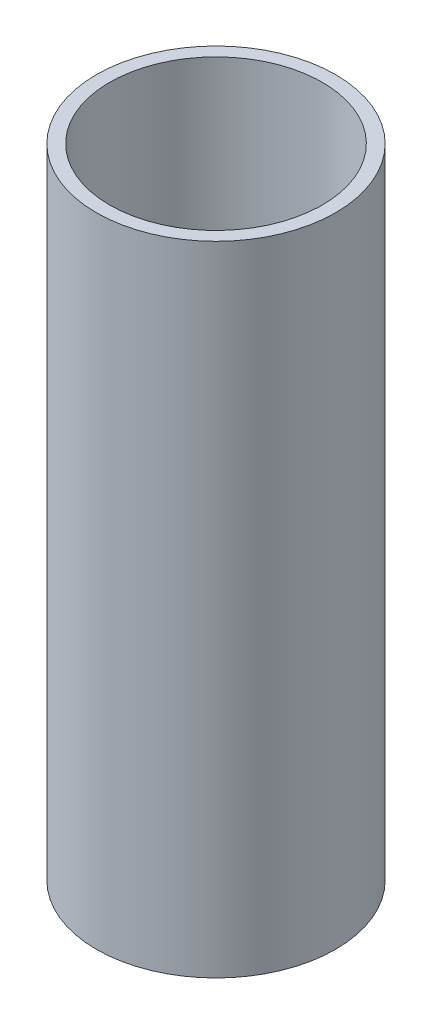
ISO-10303-21;
HEADER;
FILE_DESCRIPTION(('STEP AP214'),'2;1');
FILE_NAME('part.step','',(''),(''),'','','');
FILE_SCHEMA(('AUTOMOTIVE_DESIGN { 1 0 10303 214 1 1 1 1 }'));
ENDSEC;
DATA;
#1=APPLICATION_CONTEXT('core data for automotive mechanical design processes');
#2=APPLICATION_PROTOCOL_DEFINITION('international standard','automotive_design',2000,#1);
#3=PRODUCT_CONTEXT('',#1,'mechanical');
#4=PRODUCT('Part','Part','',(#3));
#5=PRODUCT_RELATED_PRODUCT_CATEGORY('part','',(#4));
#6=PRODUCT_DEFINITION_FORMATION('','',#4);
#7=PRODUCT_DEFINITION_CONTEXT('part definition',#1,'design');
#8=PRODUCT_DEFINITION('design','',#6,#7);
#9=PRODUCT_DEFINITION_SHAPE('','',#8);
#10=(LENGTH_UNIT() NAMED_UNIT(*) SI_UNIT(.MILLI.,.METRE.));
#11=(NAMED_UNIT(*) PLANE_ANGLE_UNIT() SI_UNIT($,.RADIAN.));
#12=(NAMED_UNIT(*) SI_UNIT($,.STERADIAN.) SOLID_ANGLE_UNIT());
#13=UNCERTAINTY_MEASURE_WITH_UNIT(LENGTH_MEASURE(1.E-05),#10,'distance_accuracy_value','');
#14=(GEOMETRIC_REPRESENTATION_CONTEXT(3) GLOBAL_UNCERTAINTY_ASSIGNED_CONTEXT((#13)) GLOBAL_UNIT_ASSIGNED_CONTEXT((#10,
#11,#12)) REPRESENTATION_CONTEXT('',''));
#15=CARTESIAN_POINT('',(0.,0.,0.));
#16=DIRECTION('',(0.,0.,1.));
#17=DIRECTION('',(1.,0.,0.));
#18=AXIS2_PLACEMENT_3D('',#15,#16,#17);
#19=CARTESIAN_POINT('',(0.,480.,0.));
#20=DIRECTION('',(0.,-1.,0.));
#21=DIRECTION('',(0.,0.,-1.));
#22=AXIS2_PLACEMENT_3D('',#19,#20,#21);
#23=CYLINDRICAL_SURFACE('',#22,90.);
#24=CARTESIAN_POINT('',(0.,480.,0.));
#25=DIRECTION('',(0.,1.,0.));
#26=DIRECTION('',(0.,0.,1.));
#27=AXIS2_PLACEMENT_3D('',#24,#25,#26);
#28=CIRCLE('',#27,90.);
#29=CARTESIAN_POINT('',(0.,480.,90.));
#30=VERTEX_POINT('',#29);
#31=EDGE_CURVE('E10',#30,#30,#28,.T.);
#32=ORIENTED_EDGE('',*,*,#31,.F.);
#33=EDGE_LOOP('',(#32));
#34=FACE_BOUND('',#33,.T.);
#35=CARTESIAN_POINT('',(0.,0.,0.));
#36=DIRECTION('',(0.,1.,0.));
#37=DIRECTION('',(0.,0.,1.));
#38=AXIS2_PLACEMENT_3D('',#35,#36,#37);
#39=CIRCLE('',#38,90.);
#40=CARTESIAN_POINT('',(0.,0.,90.));
#41=VERTEX_POINT('',#40);
#42=EDGE_CURVE('E44',#41,#41,#39,.T.);
#43=ORIENTED_EDGE('',*,*,#42,.T.);
#44=EDGE_LOOP('',(#43));
#45=FACE_BOUND('',#44,.T.);
#46=ADVANCED_FACE('F41',(#34,#45),#23,.T.);
#47=CARTESIAN_POINT('',(0.,480.,0.));
#48=DIRECTION('',(0.,1.,0.));
#49=DIRECTION('',(0.,0.,1.));
#50=AXIS2_PLACEMENT_3D('',#47,#48,#49);
#51=PLANE('',#50);
#52=CARTESIAN_POINT('',(0.,480.,0.));
#53=DIRECTION('',(0.,1.,0.));
#54=DIRECTION('',(0.,0.,1.));
#55=AXIS2_PLACEMENT_3D('',#52,#53,#54);
#56=CIRCLE('',#55,80.);
#57=CARTESIAN_POINT('',(0.,480.,80.));
#58=VERTEX_POINT('',#57);
#59=EDGE_CURVE('E59',#58,#58,#56,.T.);
#60=ORIENTED_EDGE('',*,*,#59,.F.);
#61=EDGE_LOOP('',(#60));
#62=FACE_BOUND('',#61,.T.);
#63=ORIENTED_EDGE('',*,*,#31,.T.);
#64=EDGE_LOOP('',(#63));
#65=FACE_BOUND('',#64,.T.);
#66=ADVANCED_FACE('F74',(#62,#65),#51,.T.);
#67=CARTESIAN_POINT('',(0.,0.,0.));
#68=DIRECTION('',(0.,1.,0.));
#69=DIRECTION('',(0.,0.,1.));
#70=AXIS2_PLACEMENT_3D('',#67,#68,#69);
#71=PLANE('',#70);
#72=CARTESIAN_POINT('',(0.,0.,0.));
#73=DIRECTION('',(0.,-1.,0.));
#74=DIRECTION('',(0.,0.,-1.));
#75=AXIS2_PLACEMENT_3D('',#72,#73,#74);
#76=CIRCLE('',#75,80.);
#77=CARTESIAN_POINT('',(0.,0.,-80.));
#78=VERTEX_POINT('',#77);
#79=EDGE_CURVE('E53',#78,#78,#76,.T.);
#80=ORIENTED_EDGE('',*,*,#79,.F.);
#81=EDGE_LOOP('',(#80));
#82=FACE_BOUND('',#81,.T.);
#83=ORIENTED_EDGE('',*,*,#42,.F.);
#84=EDGE_LOOP('',(#83));
#85=FACE_BOUND('',#84,.T.);
#86=ADVANCED_FACE('F76',(#82,#85),#71,.F.);
#87=CARTESIAN_POINT('',(0.,235.,0.));
#88=DIRECTION('',(0.,-1.,0.));
#89=DIRECTION('',(0.,0.,-1.));
#90=AXIS2_PLACEMENT_3D('',#87,#88,#89);
#91=CYLINDRICAL_SURFACE('',#90,80.);
#92=CARTESIAN_POINT('',(0.,235.,0.));
#93=DIRECTION('',(0.,-1.,0.));
#94=DIRECTION('',(0.,0.,-1.));
#95=AXIS2_PLACEMENT_3D('',#92,#93,#94);
#96=CIRCLE('',#95,80.);
#97=CARTESIAN_POINT('',(0.,235.,-80.));
#98=VERTEX_POINT('',#97);
#99=EDGE_CURVE('E51',#98,#98,#96,.T.);
#100=CARTESIAN_POINT('',(0.,235.,-80.));
#101=CARTESIAN_POINT('',(0.,232.552083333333,-80.));
#102=CARTESIAN_POINT('',(0.,230.104166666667,-80.));
#103=CARTESIAN_POINT('',(0.,225.208333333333,-80.));
#104=CARTESIAN_POINT('',(0.,222.760416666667,-80.));
#105=CARTESIAN_POINT('',(0.,217.864583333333,-80.));
#106=CARTESIAN_POINT('',(0.,215.416666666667,-80.));
#107=CARTESIAN_POINT('',(0.,210.520833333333,-80.));
#108=CARTESIAN_POINT('',(0.,208.072916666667,-80.));
#109=CARTESIAN_POINT('',(0.,203.177083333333,-80.));
#110=CARTESIAN_POINT('',(0.,200.729166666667,-80.));
#111=CARTESIAN_POINT('',(0.,195.833333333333,-80.));
#112=CARTESIAN_POINT('',(0.,193.385416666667,-80.));
#113=CARTESIAN_POINT('',(0.,188.489583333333,-80.));
#114=CARTESIAN_POINT('',(0.,186.041666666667,-80.));
#115=CARTESIAN_POINT('',(0.,181.145833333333,-80.));
#116=CARTESIAN_POINT('',(0.,178.697916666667,-80.));
#117=CARTESIAN_POINT('',(0.,173.802083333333,-80.));
#118=CARTESIAN_POINT('',(0.,171.354166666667,-80.));
#119=CARTESIAN_POINT('',(0.,166.458333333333,-80.));
#120=CARTESIAN_POINT('',(0.,164.010416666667,-80.));
#121=CARTESIAN_POINT('',(0.,159.114583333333,-80.));
#122=CARTESIAN_POINT('',(0.,156.666666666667,-80.));
#123=CARTESIAN_POINT('',(0.,151.770833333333,-80.));
#124=CARTESIAN_POINT('',(0.,149.322916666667,-80.));
#125=CARTESIAN_POINT('',(0.,144.427083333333,-80.));
#126=CARTESIAN_POINT('',(0.,141.979166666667,-80.));
#127=CARTESIAN_POINT('',(0.,137.083333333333,-80.));
#128=CARTESIAN_POINT('',(0.,134.635416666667,-80.));
#129=CARTESIAN_POINT('',(0.,129.739583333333,-80.));
#130=CARTESIAN_POINT('',(0.,127.291666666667,-80.));
#131=CARTESIAN_POINT('',(0.,122.395833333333,-80.));
#132=CARTESIAN_POINT('',(0.,119.947916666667,-80.));
#133=CARTESIAN_POINT('',(0.,115.052083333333,-80.));
#134=CARTESIAN_POINT('',(0.,112.604166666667,-80.));
#135=CARTESIAN_POINT('',(0.,107.708333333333,-80.));
#136=CARTESIAN_POINT('',(0.,105.260416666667,-80.));
#137=CARTESIAN_POINT('',(0.,100.364583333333,-80.));
#138=CARTESIAN_POINT('',(0.,97.9166666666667,-80.));
#139=CARTESIAN_POINT('',(0.,93.0208333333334,-80.));
#140=CARTESIAN_POINT('',(0.,90.5729166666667,-80.));
#141=CARTESIAN_POINT('',(0.,85.6770833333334,-80.));
#142=CARTESIAN_POINT('',(0.,83.2291666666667,-80.));
#143=CARTESIAN_POINT('',(0.,78.3333333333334,-80.));
#144=CARTESIAN_POINT('',(0.,75.8854166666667,-80.));
#145=CARTESIAN_POINT('',(0.,70.9895833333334,-80.));
#146=CARTESIAN_POINT('',(0.,68.5416666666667,-80.));
#147=CARTESIAN_POINT('',(0.,63.6458333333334,-80.));
#148=CARTESIAN_POINT('',(0.,61.1979166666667,-80.));
#149=CARTESIAN_POINT('',(0.,56.3020833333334,-80.));
#150=CARTESIAN_POINT('',(0.,53.8541666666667,-80.));
#151=CARTESIAN_POINT('',(0.,48.9583333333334,-80.));
#152=CARTESIAN_POINT('',(0.,46.5104166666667,-80.));
#153=CARTESIAN_POINT('',(0.,41.6145833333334,-80.));
#154=CARTESIAN_POINT('',(0.,39.1666666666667,-80.));
#155=CARTESIAN_POINT('',(0.,34.2708333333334,-80.));
#156=CARTESIAN_POINT('',(0.,31.8229166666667,-80.));
#157=CARTESIAN_POINT('',(0.,26.9270833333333,-80.));
#158=CARTESIAN_POINT('',(0.,24.4791666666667,-80.));
#159=CARTESIAN_POINT('',(0.,19.5833333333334,-80.));
#160=CARTESIAN_POINT('',(0.,17.1354166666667,-80.));
#161=CARTESIAN_POINT('',(0.,12.2395833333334,-80.));
#162=CARTESIAN_POINT('',(0.,9.7916666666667,-80.));
#163=CARTESIAN_POINT('',(0.,4.89583333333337,-80.));
#164=CARTESIAN_POINT('',(0.,2.4479166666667,-80.));
#165=CARTESIAN_POINT('',(0.,0.,-80.));
#166=B_SPLINE_CURVE_WITH_KNOTS('',3,(#100,#101,#102,#103,#104,#105,#106,#107,#108,#109,#110,
#111,#112,#113,#114,#115,#116,#117,#118,#119,#120,#121,#122,#123,#124,#125,#126,#127,#128,#129,
#130,#131,#132,#133,#134,#135,#136,#137,#138,#139,#140,#141,#142,#143,#144,#145,#146,#147,#148,
#149,#150,#151,#152,#153,#154,#155,#156,#157,#158,#159,#160,#161,#162,#163,#164,#165),
.UNSPECIFIED.,.F.,.F.,(4,2,2,2,2,2,2,2,2,2,2,2,2,2,2,2,2,2,2,2,2,2,2,2,2,2,2,2,2,2,2,2,4),(0.,
7.34374999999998,14.6875,22.03125,29.375,36.71875,44.0625,51.40625,58.75,66.09375,73.4375,
80.78125,88.125,95.46875,102.8125,110.15625,117.5,124.84375,132.1875,139.53125,146.875,
154.21875,161.5625,168.90625,176.25,183.59375,190.9375,198.28125,205.625,212.96875,220.3125,
227.65625,235.),.UNSPECIFIED.);
#167=EDGE_CURVE('BSEAM82',#98,#78,#166,.T.);
#168=ORIENTED_EDGE('',*,*,#99,.F.);
#169=ORIENTED_EDGE('',*,*,#79,.T.);
#170=ORIENTED_EDGE('',*,*,#167,.T.);
#171=ORIENTED_EDGE('',*,*,#167,.F.);
#172=EDGE_LOOP('',(#168,#170,#169,#171));
#173=FACE_BOUND('',#172,.T.);
#174=ADVANCED_FACE('F82',(#173),#91,.F.);
#175=CARTESIAN_POINT('',(0.,235.,0.));
#176=DIRECTION('',(0.,-1.,0.));
#177=DIRECTION('',(0.,0.,-1.));
#178=AXIS2_PLACEMENT_3D('',#175,#176,#177);
#179=PLANE('',#178);
#180=ORIENTED_EDGE('',*,*,#99,.T.);
#181=EDGE_LOOP('',(#180));
#182=FACE_BOUND('',#181,.T.);
#183=ADVANCED_FACE('F70',(#182),#179,.T.);
#184=CARTESIAN_POINT('',(0.,245.,0.));
#185=DIRECTION('',(0.,1.,0.));
#186=DIRECTION('',(0.,0.,1.));
#187=AXIS2_PLACEMENT_3D('',#184,#185,#186);
#188=CYLINDRICAL_SURFACE('',#187,80.);
#189=CARTESIAN_POINT('',(0.,245.,0.));
#190=DIRECTION('',(0.,1.,0.));
#191=DIRECTION('',(0.,0.,1.));
#192=AXIS2_PLACEMENT_3D('',#189,#190,#191);
#193=CIRCLE('',#192,80.);
#194=CARTESIAN_POINT('',(0.,245.,80.));
#195=VERTEX_POINT('',#194);
#196=EDGE_CURVE('E56',#195,#195,#193,.T.);
#197=CARTESIAN_POINT('',(0.,245.,80.));
#198=CARTESIAN_POINT('',(0.,247.447916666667,80.));
#199=CARTESIAN_POINT('',(0.,249.895833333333,80.));
#200=CARTESIAN_POINT('',(0.,254.791666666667,80.));
#201=CARTESIAN_POINT('',(0.,257.239583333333,80.));
#202=CARTESIAN_POINT('',(0.,262.135416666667,80.));
#203=CARTESIAN_POINT('',(0.,264.583333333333,80.));
#204=CARTESIAN_POINT('',(0.,269.479166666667,80.));
#205=CARTESIAN_POINT('',(0.,271.927083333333,80.));
#206=CARTESIAN_POINT('',(0.,276.822916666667,80.));
#207=CARTESIAN_POINT('',(0.,279.270833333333,80.));
#208=CARTESIAN_POINT('',(0.,284.166666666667,80.));
#209=CARTESIAN_POINT('',(0.,286.614583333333,80.));
#210=CARTESIAN_POINT('',(0.,291.510416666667,80.));
#211=CARTESIAN_POINT('',(0.,293.958333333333,80.));
#212=CARTESIAN_POINT('',(0.,298.854166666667,80.));
#213=CARTESIAN_POINT('',(0.,301.302083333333,80.));
#214=CARTESIAN_POINT('',(0.,306.197916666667,80.));
#215=CARTESIAN_POINT('',(0.,308.645833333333,80.));
#216=CARTESIAN_POINT('',(0.,313.541666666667,80.));
#217=CARTESIAN_POINT('',(0.,315.989583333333,80.));
#218=CARTESIAN_POINT('',(0.,320.885416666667,80.));
#219=CARTESIAN_POINT('',(0.,323.333333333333,80.));
#220=CARTESIAN_POINT('',(0.,328.229166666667,80.));
#221=CARTESIAN_POINT('',(0.,330.677083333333,80.));
#222=CARTESIAN_POINT('',(0.,335.572916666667,80.));
#223=CARTESIAN_POINT('',(0.,338.020833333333,80.));
#224=CARTESIAN_POINT('',(0.,342.916666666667,80.));
#225=CARTESIAN_POINT('',(0.,345.364583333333,80.));
#226=CARTESIAN_POINT('',(0.,350.260416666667,80.));
#227=CARTESIAN_POINT('',(0.,352.708333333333,80.));
#228=CARTESIAN_POINT('',(0.,357.604166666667,80.));
#229=CARTESIAN_POINT('',(0.,360.052083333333,80.));
#230=CARTESIAN_POINT('',(0.,364.947916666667,80.));
#231=CARTESIAN_POINT('',(0.,367.395833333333,80.));
#232=CARTESIAN_POINT('',(0.,372.291666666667,80.));
#233=CARTESIAN_POINT('',(0.,374.739583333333,80.));
#234=CARTESIAN_POINT('',(0.,379.635416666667,80.));
#235=CARTESIAN_POINT('',(0.,382.083333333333,80.));
#236=CARTESIAN_POINT('',(0.,386.979166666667,80.));
#237=CARTESIAN_POINT('',(0.,389.427083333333,80.));
#238=CARTESIAN_POINT('',(0.,394.322916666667,80.));
#239=CARTESIAN_POINT('',(0.,396.770833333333,80.));
#240=CARTESIAN_POINT('',(0.,401.666666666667,80.));
#241=CARTESIAN_POINT('',(0.,404.114583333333,80.));
#242=CARTESIAN_POINT('',(0.,409.010416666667,80.));
#243=CARTESIAN_POINT('',(0.,411.458333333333,80.));
#244=CARTESIAN_POINT('',(0.,416.354166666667,80.));
#245=CARTESIAN_POINT('',(0.,418.802083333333,80.));
#246=CARTESIAN_POINT('',(0.,423.697916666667,80.));
#247=CARTESIAN_POINT('',(0.,426.145833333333,80.));
#248=CARTESIAN_POINT('',(0.,431.041666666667,80.));
#249=CARTESIAN_POINT('',(0.,433.489583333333,80.));
#250=CARTESIAN_POINT('',(0.,438.385416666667,80.));
#251=CARTESIAN_POINT('',(0.,440.833333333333,80.));
#252=CARTESIAN_POINT('',(0.,445.729166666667,80.));
#253=CARTESIAN_POINT('',(0.,448.177083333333,80.));
#254=CARTESIAN_POINT('',(0.,453.072916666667,80.));
#255=CARTESIAN_POINT('',(0.,455.520833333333,80.));
#256=CARTESIAN_POINT('',(0.,460.416666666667,80.));
#257=CARTESIAN_POINT('',(0.,462.864583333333,80.));
#258=CARTESIAN_POINT('',(0.,467.760416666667,80.));
#259=CARTESIAN_POINT('',(0.,470.208333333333,80.));
#260=CARTESIAN_POINT('',(0.,475.104166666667,80.));
#261=CARTESIAN_POINT('',(0.,477.552083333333,80.));
#262=CARTESIAN_POINT('',(0.,480.,80.));
#263=B_SPLINE_CURVE_WITH_KNOTS('',3,(#197,#198,#199,#200,#201,#202,#203,#204,#205,#206,#207,
#208,#209,#210,#211,#212,#213,#214,#215,#216,#217,#218,#219,#220,#221,#222,#223,#224,#225,#226,
#227,#228,#229,#230,#231,#232,#233,#234,#235,#236,#237,#238,#239,#240,#241,#242,#243,#244,#245,
#246,#247,#248,#249,#250,#251,#252,#253,#254,#255,#256,#257,#258,#259,#260,#261,#262),
.UNSPECIFIED.,.F.,.F.,(4,2,2,2,2,2,2,2,2,2,2,2,2,2,2,2,2,2,2,2,2,2,2,2,2,2,2,2,2,2,2,2,4),(0.,
7.34374999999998,14.6875,22.03125,29.375,36.71875,44.0625,51.40625,58.75,66.09375,
73.4374999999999,80.78125,88.125,95.46875,102.8125,110.15625,117.5,124.84375,132.1875,139.53125,
146.875,154.21875,161.5625,168.90625,176.25,183.59375,190.9375,198.28125,205.625,212.96875,
220.3125,227.65625,235.),.UNSPECIFIED.);
#264=EDGE_CURVE('BSEAM67',#195,#58,#263,.T.);
#265=ORIENTED_EDGE('',*,*,#196,.F.);
#266=ORIENTED_EDGE('',*,*,#59,.T.);
#267=ORIENTED_EDGE('',*,*,#264,.T.);
#268=ORIENTED_EDGE('',*,*,#264,.F.);
#269=EDGE_LOOP('',(#265,#267,#266,#268));
#270=FACE_BOUND('',#269,.T.);
#271=ADVANCED_FACE('F67',(#270),#188,.F.);
#272=CARTESIAN_POINT('',(0.,245.,0.));
#273=DIRECTION('',(0.,1.,0.));
#274=DIRECTION('',(0.,0.,1.));
#275=AXIS2_PLACEMENT_3D('',#272,#273,#274);
#276=PLANE('',#275);
#277=ORIENTED_EDGE('',*,*,#196,.T.);
#278=EDGE_LOOP('',(#277));
#279=FACE_BOUND('',#278,.T.);
#280=ADVANCED_FACE('F65',(#279),#276,.T.);
#281=CLOSED_SHELL('',(#46,#66,#86,#174,#183,#271,#280));
#282=MANIFOLD_SOLID_BREP('B2',#281);
#283=ADVANCED_BREP_SHAPE_REPRESENTATION('',(#18,#282),#14);
#284=SHAPE_DEFINITION_REPRESENTATION(#9,#283);
ENDSEC;
END-ISO-10303-21;
